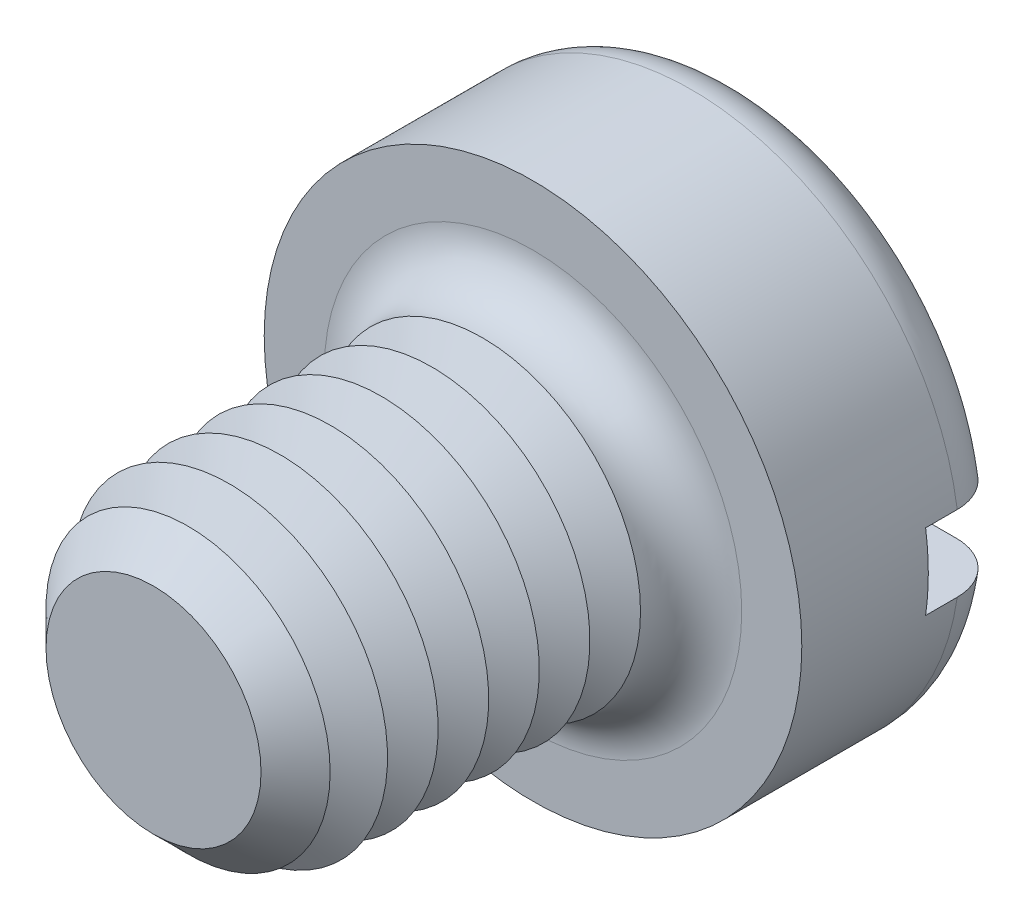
ISO-10303-21;
HEADER;
FILE_DESCRIPTION(('STEP AP214'),'2;1');
FILE_NAME('part.step','',(''),(''),'','','');
FILE_SCHEMA(('AUTOMOTIVE_DESIGN { 1 0 10303 214 1 1 1 1 }'));
ENDSEC;
DATA;
#1=APPLICATION_CONTEXT('core data for automotive mechanical design processes');
#2=APPLICATION_PROTOCOL_DEFINITION('international standard','automotive_design',2000,#1);
#3=PRODUCT_CONTEXT('',#1,'mechanical');
#4=PRODUCT('Part','Part','',(#3));
#5=PRODUCT_RELATED_PRODUCT_CATEGORY('part','',(#4));
#6=PRODUCT_DEFINITION_FORMATION('','',#4);
#7=PRODUCT_DEFINITION_CONTEXT('part definition',#1,'design');
#8=PRODUCT_DEFINITION('design','',#6,#7);
#9=PRODUCT_DEFINITION_SHAPE('','',#8);
#10=(LENGTH_UNIT() NAMED_UNIT(*) SI_UNIT(.MILLI.,.METRE.));
#11=(NAMED_UNIT(*) PLANE_ANGLE_UNIT() SI_UNIT($,.RADIAN.));
#12=(NAMED_UNIT(*) SI_UNIT($,.STERADIAN.) SOLID_ANGLE_UNIT());
#13=UNCERTAINTY_MEASURE_WITH_UNIT(LENGTH_MEASURE(1.E-05),#10,'distance_accuracy_value','');
#14=(GEOMETRIC_REPRESENTATION_CONTEXT(3) GLOBAL_UNCERTAINTY_ASSIGNED_CONTEXT((#13)) GLOBAL_UNIT_ASSIGNED_CONTEXT((#10,
#11,#12)) REPRESENTATION_CONTEXT('',''));
#15=CARTESIAN_POINT('',(0.,0.,0.));
#16=DIRECTION('',(0.,0.,1.));
#17=DIRECTION('',(1.,0.,0.));
#18=AXIS2_PLACEMENT_3D('',#15,#16,#17);
#19=CARTESIAN_POINT('',(0.,0.,-3.3));
#20=DIRECTION('',(0.,0.,1.));
#21=DIRECTION('',(1.,0.,0.));
#22=AXIS2_PLACEMENT_3D('',#19,#20,#21);
#23=PLANE('',#22);
#24=CARTESIAN_POINT('',(0.,0.,-3.3));
#25=DIRECTION('',(0.,0.,1.));
#26=DIRECTION('',(1.,0.,0.));
#27=AXIS2_PLACEMENT_3D('',#24,#25,#26);
#28=CIRCLE('',#27,3.45);
#29=CARTESIAN_POINT('',(-3.39742549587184,0.6,-3.3));
#30=VERTEX_POINT('',#29);
#31=CARTESIAN_POINT('',(3.39742549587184,0.599999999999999,-3.3));
#32=VERTEX_POINT('',#31);
#33=EDGE_CURVE('E116',#30,#32,#28,.F.);
#34=ORIENTED_EDGE('',*,*,#33,.T.);
#35=DIRECTION('',(1.,0.,0.));
#36=VECTOR('',#35,1.);
#37=CARTESIAN_POINT('',(-4.25,0.6,-3.3));
#38=LINE('',#37,#36);
#39=EDGE_CURVE('E111',#30,#32,#38,.T.);
#40=ORIENTED_EDGE('',*,*,#39,.F.);
#41=EDGE_LOOP('',(#34,#40));
#42=FACE_BOUND('',#41,.T.);
#43=ADVANCED_FACE('F39',(#42),#23,.F.);
#44=CARTESIAN_POINT('',(0.,0.,-2.5));
#45=DIRECTION('',(0.,0.,1.));
#46=DIRECTION('',(1.,0.,0.));
#47=AXIS2_PLACEMENT_3D('',#44,#45,#46);
#48=TOROIDAL_SURFACE('',#47,3.45,0.8);
#49=CARTESIAN_POINT('',(-4.06369072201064,0.6,-2.95537828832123));
#50=CARTESIAN_POINT('',(-4.03774340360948,0.6,-2.99245078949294));
#51=CARTESIAN_POINT('',(-4.00861849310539,0.6,-3.02734231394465));
#52=CARTESIAN_POINT('',(-3.94488199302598,0.6,-3.0917502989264));
#53=CARTESIAN_POINT('',(-3.91026320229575,0.6,-3.12125959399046));
#54=CARTESIAN_POINT('',(-3.83660561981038,0.6,-3.17403695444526));
#55=CARTESIAN_POINT('',(-3.79757117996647,0.6,-3.19731109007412));
#56=CARTESIAN_POINT('',(-3.71618817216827,0.6,-3.23703443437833));
#57=CARTESIAN_POINT('',(-3.67384041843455,0.6,-3.25348531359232));
#58=CARTESIAN_POINT('',(-3.58661930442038,0.6,-3.2792758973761));
#59=CARTESIAN_POINT('',(-3.54172669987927,0.6,-3.288550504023));
#60=CARTESIAN_POINT('',(-3.45102322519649,0.6,-3.29952632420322));
#61=CARTESIAN_POINT('',(-3.40521225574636,0.6,-3.30122671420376));
#62=CARTESIAN_POINT('',(-3.31340831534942,0.6,-3.29701196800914));
#63=CARTESIAN_POINT('',(-3.26741940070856,0.6,-3.29100823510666));
#64=CARTESIAN_POINT('',(-3.17708556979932,0.6,-3.27141469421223));
#65=CARTESIAN_POINT('',(-3.13274074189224,0.6,-3.25782447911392));
#66=CARTESIAN_POINT('',(-3.04668142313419,0.6,-3.22332549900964));
#67=CARTESIAN_POINT('',(-3.00498444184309,0.6,-3.20237301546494));
#68=CARTESIAN_POINT('',(-2.92572251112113,0.6,-3.15372961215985));
#69=CARTESIAN_POINT('',(-2.88815755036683,0.6,-3.12603871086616));
#70=CARTESIAN_POINT('',(-2.81847654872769,0.6,-3.06483322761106));
#71=CARTESIAN_POINT('',(-2.78633186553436,0.6,-3.03135128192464));
#72=CARTESIAN_POINT('',(-2.72824805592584,0.6,-2.95937651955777));
#73=CARTESIAN_POINT('',(-2.70230829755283,0.6,-2.92088421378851));
#74=CARTESIAN_POINT('',(-2.65791262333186,0.6,-2.84074227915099));
#75=CARTESIAN_POINT('',(-2.6393256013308,0.6,-2.79916531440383));
#76=CARTESIAN_POINT('',(-2.60958432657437,0.6,-2.7134333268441));
#77=CARTESIAN_POINT('',(-2.59842889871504,0.6,-2.66927871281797));
#78=CARTESIAN_POINT('',(-2.58411140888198,0.6,-2.58073966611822));
#79=CARTESIAN_POINT('',(-2.58077086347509,0.6,-2.5363840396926));
#80=CARTESIAN_POINT('',(-2.58167367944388,0.6,-2.44775208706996));
#81=CARTESIAN_POINT('',(-2.58591644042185,0.6,-2.40347575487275));
#82=CARTESIAN_POINT('',(-2.60175154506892,0.6,-2.31675105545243));
#83=CARTESIAN_POINT('',(-2.61326489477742,0.6,-2.27428821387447));
#84=CARTESIAN_POINT('',(-2.6431863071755,0.6,-2.19186794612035));
#85=CARTESIAN_POINT('',(-2.66159465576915,0.6,-2.15191062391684));
#86=CARTESIAN_POINT('',(-2.70494650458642,0.6,-2.07517696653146));
#87=CARTESIAN_POINT('',(-2.72995486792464,0.6,-2.03843731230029));
#88=CARTESIAN_POINT('',(-2.7856570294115,0.6,-1.96955746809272));
#89=CARTESIAN_POINT('',(-2.8163514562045,0.6,-1.93741778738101));
#90=CARTESIAN_POINT('',(-2.88329572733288,0.6,-1.87788048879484));
#91=CARTESIAN_POINT('',(-2.91965530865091,0.6,-1.85060625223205));
#92=CARTESIAN_POINT('',(-2.9963658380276,0.6,-1.80241044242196));
#93=CARTESIAN_POINT('',(-3.03671721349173,0.6,-1.78148955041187));
#94=CARTESIAN_POINT('',(-3.12111125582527,0.6,-1.74619829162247));
#95=CARTESIAN_POINT('',(-3.16521020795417,0.6,-1.73196239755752));
#96=CARTESIAN_POINT('',(-3.25516487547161,0.6,-1.71103773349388));
#97=CARTESIAN_POINT('',(-3.30102068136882,0.6,-1.70434935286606));
#98=CARTESIAN_POINT('',(-3.39352689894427,0.6,-1.69870104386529));
#99=CARTESIAN_POINT('',(-3.44018061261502,0.6,-1.69979487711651));
#100=CARTESIAN_POINT('',(-3.53263583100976,0.6,-1.70983959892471));
#101=CARTESIAN_POINT('',(-3.57843734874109,0.6,-1.71879036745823));
#102=CARTESIAN_POINT('',(-3.66763544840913,0.6,-1.74426972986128));
#103=CARTESIAN_POINT('',(-3.71104292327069,0.6,-1.76076015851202));
#104=CARTESIAN_POINT('',(-3.79442616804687,0.6,-1.80087686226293));
#105=CARTESIAN_POINT('',(-3.83440212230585,0.6,-1.82450275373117));
#106=CARTESIAN_POINT('',(-3.90929765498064,0.6,-1.87793548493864));
#107=CARTESIAN_POINT('',(-3.94426963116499,0.6,-1.90766887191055));
#108=CARTESIAN_POINT('',(-4.00864839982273,0.6,-1.9726503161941));
#109=CARTESIAN_POINT('',(-4.03805555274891,0.6,-2.00789801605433));
#110=CARTESIAN_POINT('',(-4.09009460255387,0.6,-2.08244463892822));
#111=CARTESIAN_POINT('',(-4.11280448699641,0.6,-2.12168912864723));
#112=CARTESIAN_POINT('',(-4.15124086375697,0.6,-2.2034588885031));
#113=CARTESIAN_POINT('',(-4.16696802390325,0.6,-2.24598384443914));
#114=CARTESIAN_POINT('',(-4.19085131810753,0.6,-2.33267862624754));
#115=CARTESIAN_POINT('',(-4.19907708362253,0.6,-2.37682928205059));
#116=CARTESIAN_POINT('',(-4.2079638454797,0.6,-2.46589754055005));
#117=CARTESIAN_POINT('',(-4.20862315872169,0.6,-2.51081531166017));
#118=CARTESIAN_POINT('',(-4.20236829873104,0.6,-2.59993343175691));
#119=CARTESIAN_POINT('',(-4.19548454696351,0.6,-2.64413593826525));
#120=CARTESIAN_POINT('',(-4.17439924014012,0.6,-2.73071930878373));
#121=CARTESIAN_POINT('',(-4.16020675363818,0.6,-2.77310235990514));
#122=CARTESIAN_POINT('',(-4.1318825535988,0.6,-2.83880495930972));
#123=CARTESIAN_POINT('',(-4.11991183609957,0.6,-2.86307959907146));
#124=CARTESIAN_POINT('',(-4.09356927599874,0.6,-2.91028856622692));
#125=CARTESIAN_POINT('',(-4.07919744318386,0.6,-2.9332228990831));
#126=CARTESIAN_POINT('',(-4.06369072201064,0.6,-2.95537828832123));
#127=B_SPLINE_CURVE_WITH_KNOTS('',3,(#49,#50,#51,#52,#53,#54,#55,#56,#57,#58,#59,#60,#61,#62,
#63,#64,#65,#66,#67,#68,#69,#70,#71,#72,#73,#74,#75,#76,#77,#78,#79,#80,#81,#82,#83,#84,#85,#86,
#87,#88,#89,#90,#91,#92,#93,#94,#95,#96,#97,#98,#99,#100,#101,#102,#103,#104,#105,#106,#107,
#108,#109,#110,#111,#112,#113,#114,#115,#116,#117,#118,#119,#120,#121,#122,#123,#124,#125,#126),
.UNSPECIFIED.,.T.,.F.,(4,2,2,2,2,2,2,2,2,2,2,2,2,2,2,2,2,2,2,2,2,2,2,2,2,2,2,2,2,2,2,2,2,2,2,2,
2,2,4),(0.,0.135652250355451,0.271483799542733,0.407182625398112,0.54284820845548,
0.679730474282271,0.81662762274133,0.95511327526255,1.09360635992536,1.23293614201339,
1.3722655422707,1.51083389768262,1.64938813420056,1.78534653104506,1.92128342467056,
2.0540840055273,2.18687407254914,2.31824564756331,2.44962267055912,2.58234229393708,
2.71507659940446,2.85080630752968,2.98655056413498,3.12491938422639,3.26329534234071,
3.40262816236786,3.54195885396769,3.68059194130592,3.81921757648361,3.95626453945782,
4.09330262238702,4.2286754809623,4.36403538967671,4.49812564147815,4.63224572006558,
4.76582687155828,4.89924267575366,4.98031194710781,5.06138088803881),.UNSPECIFIED.);
#128=CARTESIAN_POINT('',(-4.20743389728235,0.6,-2.50000000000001));
#129=VERTEX_POINT('',#128);
#130=EDGE_CURVE('E233',#129,#30,#127,.T.);
#131=ORIENTED_EDGE('',*,*,#130,.F.);
#132=CARTESIAN_POINT('',(0.,0.,-2.5));
#133=DIRECTION('',(0.,0.,1.));
#134=DIRECTION('',(1.,0.,0.));
#135=AXIS2_PLACEMENT_3D('',#132,#133,#134);
#136=CIRCLE('',#135,4.25);
#137=CARTESIAN_POINT('',(4.20743389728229,0.599999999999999,-2.5));
#138=VERTEX_POINT('',#137);
#139=EDGE_CURVE('E125',#138,#129,#136,.T.);
#140=ORIENTED_EDGE('',*,*,#139,.F.);
#141=CARTESIAN_POINT('',(2.63947327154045,0.6,-2.79608831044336));
#142=CARTESIAN_POINT('',(2.65655980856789,0.6,-2.83790320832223));
#143=CARTESIAN_POINT('',(2.67725642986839,0.6,-2.87828303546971));
#144=CARTESIAN_POINT('',(2.72519250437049,0.6,-2.95500233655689));
#145=CARTESIAN_POINT('',(2.75244152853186,0.6,-2.9913357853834));
#146=CARTESIAN_POINT('',(2.81257938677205,0.6,-3.05889430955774));
#147=CARTESIAN_POINT('',(2.84545995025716,0.6,-3.09012674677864));
#148=CARTESIAN_POINT('',(2.91591143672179,0.6,-3.14672620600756));
#149=CARTESIAN_POINT('',(2.95348119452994,0.599999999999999,-3.17209468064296));
#150=CARTESIAN_POINT('',(3.03291143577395,0.599999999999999,-3.21669611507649));
#151=CARTESIAN_POINT('',(3.07483186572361,0.599999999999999,-3.23582234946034));
#152=CARTESIAN_POINT('',(3.16126659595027,0.599999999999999,-3.26686062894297));
#153=CARTESIAN_POINT('',(3.2057811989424,0.599999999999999,-3.27877183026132));
#154=CARTESIAN_POINT('',(3.29669878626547,0.599999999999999,-3.29514603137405));
#155=CARTESIAN_POINT('',(3.34311773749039,0.599999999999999,-3.29952056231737));
#156=CARTESIAN_POINT('',(3.43603189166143,0.599999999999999,-3.30040472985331));
#157=CARTESIAN_POINT('',(3.48252709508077,0.599999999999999,-3.29691431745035));
#158=CARTESIAN_POINT('',(3.57420049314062,0.599999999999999,-3.28214240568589));
#159=CARTESIAN_POINT('',(3.61938038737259,0.599999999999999,-3.27087147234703));
#160=CARTESIAN_POINT('',(3.70717477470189,0.599999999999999,-3.24082890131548));
#161=CARTESIAN_POINT('',(3.74978938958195,0.599999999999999,-3.22205762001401));
#162=CARTESIAN_POINT('',(3.83078828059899,0.599999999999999,-3.17773607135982));
#163=CARTESIAN_POINT('',(3.86921015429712,0.599999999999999,-3.15225453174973));
#164=CARTESIAN_POINT('',(3.94116038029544,0.599999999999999,-3.09512672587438));
#165=CARTESIAN_POINT('',(3.9746890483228,0.599999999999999,-3.06348085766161));
#166=CARTESIAN_POINT('',(4.03545911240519,0.599999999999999,-2.99534640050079));
#167=CARTESIAN_POINT('',(4.06277344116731,0.599999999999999,-2.95892285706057));
#168=CARTESIAN_POINT('',(4.11082191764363,0.599999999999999,-2.88196698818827));
#169=CARTESIAN_POINT('',(4.13155647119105,0.599999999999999,-2.84143491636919));
#170=CARTESIAN_POINT('',(4.16563480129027,0.599999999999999,-2.75787550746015));
#171=CARTESIAN_POINT('',(4.1790544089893,0.599999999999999,-2.71487908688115));
#172=CARTESIAN_POINT('',(4.19843340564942,0.599999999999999,-2.62723691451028));
#173=CARTESIAN_POINT('',(4.20439310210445,0.599999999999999,-2.58259123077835));
#174=CARTESIAN_POINT('',(4.2086595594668,0.599999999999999,-2.49321831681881));
#175=CARTESIAN_POINT('',(4.20701422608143,0.599999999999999,-2.4484933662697));
#176=CARTESIAN_POINT('',(4.1962295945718,0.599999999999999,-2.35995704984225));
#177=CARTESIAN_POINT('',(4.18709040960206,0.599999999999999,-2.31614567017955));
#178=CARTESIAN_POINT('',(4.16160290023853,0.599999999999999,-2.23072100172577));
#179=CARTESIAN_POINT('',(4.14526169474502,0.599999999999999,-2.18910558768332));
#180=CARTESIAN_POINT('',(4.10585410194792,0.599999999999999,-2.10919238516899));
#181=CARTESIAN_POINT('',(4.08278762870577,0.599999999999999,-2.07089463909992));
#182=CARTESIAN_POINT('',(4.030487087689,0.599999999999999,-1.99851484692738));
#183=CARTESIAN_POINT('',(4.00122628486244,0.599999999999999,-1.9644521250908));
#184=CARTESIAN_POINT('',(3.93744772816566,0.599999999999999,-1.90166877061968));
#185=CARTESIAN_POINT('',(3.90292977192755,0.599999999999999,-1.87294834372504));
#186=CARTESIAN_POINT('',(3.82928727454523,0.599999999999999,-1.82137853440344));
#187=CARTESIAN_POINT('',(3.79012374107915,0.599999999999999,-1.79858484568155));
#188=CARTESIAN_POINT('',(3.70856025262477,0.599999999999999,-1.75980712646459));
#189=CARTESIAN_POINT('',(3.66616010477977,0.599999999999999,-1.74382350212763));
#190=CARTESIAN_POINT('',(3.57878495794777,0.599999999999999,-1.71891499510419));
#191=CARTESIAN_POINT('',(3.53378519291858,0.599999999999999,-1.71007699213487));
#192=CARTESIAN_POINT('',(3.44294322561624,0.599999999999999,-1.69998722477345));
#193=CARTESIAN_POINT('',(3.3971009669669,0.599999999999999,-1.69873596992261));
#194=CARTESIAN_POINT('',(3.30531297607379,0.599999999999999,-1.70385439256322));
#195=CARTESIAN_POINT('',(3.25937213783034,0.599999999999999,-1.71031204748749));
#196=CARTESIAN_POINT('',(3.1692099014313,0.599999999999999,-1.73080107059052));
#197=CARTESIAN_POINT('',(3.12498860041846,0.599999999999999,-1.74483286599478));
#198=CARTESIAN_POINT('',(3.03926209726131,0.599999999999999,-1.78018941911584));
#199=CARTESIAN_POINT('',(2.99777407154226,0.6,-1.80155586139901));
#200=CARTESIAN_POINT('',(2.91899881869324,0.6,-1.85098881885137));
#201=CARTESIAN_POINT('',(2.88171158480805,0.6,-1.8790553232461));
#202=CARTESIAN_POINT('',(2.81266124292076,0.6,-1.94094884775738));
#203=CARTESIAN_POINT('',(2.78086710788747,0.6,-1.97474122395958));
#204=CARTESIAN_POINT('',(2.72353615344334,0.6,-2.0472724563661));
#205=CARTESIAN_POINT('',(2.69799841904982,0.6,-2.08601058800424));
#206=CARTESIAN_POINT('',(2.65444718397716,0.6,-2.16655019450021));
#207=CARTESIAN_POINT('',(2.63629889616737,0.6,-2.20827875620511));
#208=CARTESIAN_POINT('',(2.60744942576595,0.6,-2.29424821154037));
#209=CARTESIAN_POINT('',(2.59674901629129,0.6,-2.33848936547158));
#210=CARTESIAN_POINT('',(2.5833312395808,0.6,-2.42714258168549));
#211=CARTESIAN_POINT('',(2.58043995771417,0.6,-2.47152848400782));
#212=CARTESIAN_POINT('',(2.58224493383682,0.6,-2.56010574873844));
#213=CARTESIAN_POINT('',(2.58693104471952,0.6,-2.60429729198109));
#214=CARTESIAN_POINT('',(2.60020046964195,0.6,-2.67311978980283));
#215=CARTESIAN_POINT('',(2.60635343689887,0.6,-2.69824441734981));
#216=CARTESIAN_POINT('',(2.62110140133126,0.6,-2.74776540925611));
#217=CARTESIAN_POINT('',(2.62969634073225,0.6,-2.77216179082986));
#218=CARTESIAN_POINT('',(2.63947327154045,0.6,-2.79608831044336));
#219=B_SPLINE_CURVE_WITH_KNOTS('',3,(#141,#142,#143,#144,#145,#146,#147,#148,#149,#150,#151,
#152,#153,#154,#155,#156,#157,#158,#159,#160,#161,#162,#163,#164,#165,#166,#167,#168,#169,#170,
#171,#172,#173,#174,#175,#176,#177,#178,#179,#180,#181,#182,#183,#184,#185,#186,#187,#188,#189,
#190,#191,#192,#193,#194,#195,#196,#197,#198,#199,#200,#201,#202,#203,#204,#205,#206,#207,#208,
#209,#210,#211,#212,#213,#214,#215,#216,#217,#218),.UNSPECIFIED.,.T.,.F.,(4,2,2,2,2,2,2,2,2,2,2,
2,2,2,2,2,2,2,2,2,2,2,2,2,2,2,2,2,2,2,2,2,2,2,2,2,2,2,4),(0.,0.135416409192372,
0.271031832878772,0.406449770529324,0.541834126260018,0.679424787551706,0.817031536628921,
0.956242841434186,1.09545501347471,1.23447850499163,1.37349539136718,1.51114036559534,
1.64877645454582,1.78470267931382,1.92062051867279,2.05510117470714,2.1895762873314,
2.32320547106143,2.45683263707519,2.59032801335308,2.72382509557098,2.85791055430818,
2.99200117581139,3.12730969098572,3.26262627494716,3.39956435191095,3.53651162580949,
3.67503685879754,3.81356990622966,3.95290367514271,4.09223721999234,4.23075602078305,
4.36925455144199,4.5050994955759,4.6409585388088,4.77376594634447,4.90639565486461,
4.98388287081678,5.06136825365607),.UNSPECIFIED.);
#220=EDGE_CURVE('E235',#32,#138,#219,.T.);
#221=ORIENTED_EDGE('',*,*,#220,.F.);
#222=ORIENTED_EDGE('',*,*,#33,.F.);
#223=EDGE_LOOP('',(#131,#140,#221,#222));
#224=FACE_BOUND('',#223,.T.);
#225=ADVANCED_FACE('F217',(#224),#48,.T.);
#226=CARTESIAN_POINT('',(0.,0.,-3.3));
#227=DIRECTION('',(0.,0.,1.));
#228=DIRECTION('',(1.,0.,0.));
#229=AXIS2_PLACEMENT_3D('',#226,#227,#228);
#230=CYLINDRICAL_SURFACE('',#229,4.25);
#231=DIRECTION('',(0.,0.,1.));
#232=VECTOR('',#231,1.);
#233=CARTESIAN_POINT('',(4.20743389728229,0.599999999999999,-3.3));
#234=LINE('',#233,#232);
#235=CARTESIAN_POINT('',(4.20743389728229,0.599999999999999,-2.));
#236=VERTEX_POINT('',#235);
#237=EDGE_CURVE('E250',#138,#236,#234,.T.);
#238=ORIENTED_EDGE('',*,*,#237,.F.);
#239=ORIENTED_EDGE('',*,*,#139,.T.);
#240=DIRECTION('',(0.,0.,1.));
#241=VECTOR('',#240,1.);
#242=CARTESIAN_POINT('',(-4.20743389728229,0.6,-3.3));
#243=LINE('',#242,#241);
#244=CARTESIAN_POINT('',(-4.20743389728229,0.6,-2.));
#245=VERTEX_POINT('',#244);
#246=EDGE_CURVE('E63',#245,#129,#243,.F.);
#247=ORIENTED_EDGE('',*,*,#246,.F.);
#248=CARTESIAN_POINT('',(0.,0.,-2.));
#249=DIRECTION('',(0.,0.,-1.));
#250=DIRECTION('',(-1.,0.,0.));
#251=AXIS2_PLACEMENT_3D('',#248,#249,#250);
#252=CIRCLE('',#251,4.25);
#253=CARTESIAN_POINT('',(-4.20743389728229,-0.6,-2.));
#254=VERTEX_POINT('',#253);
#255=EDGE_CURVE('E43',#245,#254,#252,.F.);
#256=ORIENTED_EDGE('',*,*,#255,.T.);
#257=DIRECTION('',(0.,0.,1.));
#258=VECTOR('',#257,1.);
#259=CARTESIAN_POINT('',(-4.20743389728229,-0.6,-3.3));
#260=LINE('',#259,#258);
#261=CARTESIAN_POINT('',(-4.20743389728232,-0.6,-2.5));
#262=VERTEX_POINT('',#261);
#263=EDGE_CURVE('E247',#262,#254,#260,.T.);
#264=ORIENTED_EDGE('',*,*,#263,.F.);
#265=CARTESIAN_POINT('',(4.20743389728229,-0.600000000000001,-2.5));
#266=VERTEX_POINT('',#265);
#267=EDGE_CURVE('E127',#262,#266,#136,.T.);
#268=ORIENTED_EDGE('',*,*,#267,.T.);
#269=DIRECTION('',(0.,0.,1.));
#270=VECTOR('',#269,1.);
#271=CARTESIAN_POINT('',(4.20743389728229,-0.600000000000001,-3.3));
#272=LINE('',#271,#270);
#273=CARTESIAN_POINT('',(4.20743389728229,-0.600000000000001,-2.));
#274=VERTEX_POINT('',#273);
#275=EDGE_CURVE('E55',#274,#266,#272,.F.);
#276=ORIENTED_EDGE('',*,*,#275,.F.);
#277=EDGE_CURVE('E11',#274,#236,#252,.F.);
#278=ORIENTED_EDGE('',*,*,#277,.T.);
#279=EDGE_LOOP('',(#238,#239,#247,#256,#264,#268,#276,#278));
#280=FACE_BOUND('',#279,.T.);
#281=CARTESIAN_POINT('',(0.,0.,0.));
#282=DIRECTION('',(0.,0.,1.));
#283=DIRECTION('',(1.,0.,0.));
#284=AXIS2_PLACEMENT_3D('',#281,#282,#283);
#285=CIRCLE('',#284,4.25);
#286=CARTESIAN_POINT('',(4.25,0.,0.));
#287=VERTEX_POINT('',#286);
#288=EDGE_CURVE('E253',#287,#287,#285,.T.);
#289=ORIENTED_EDGE('',*,*,#288,.F.);
#290=EDGE_LOOP('',(#289));
#291=FACE_BOUND('',#290,.T.);
#292=ADVANCED_FACE('F213',(#280,#291),#230,.T.);
#293=CARTESIAN_POINT('',(3.39742549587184,-0.600000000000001,-3.3));
#294=VERTEX_POINT('',#293);
#295=CARTESIAN_POINT('',(-3.39742549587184,-0.6,-3.3));
#296=VERTEX_POINT('',#295);
#297=EDGE_CURVE('E109',#294,#296,#28,.F.);
#298=ORIENTED_EDGE('',*,*,#297,.T.);
#299=DIRECTION('',(-1.,0.,0.));
#300=VECTOR('',#299,1.);
#301=CARTESIAN_POINT('',(-4.25,-0.6,-3.3));
#302=LINE('',#301,#300);
#303=EDGE_CURVE('E96',#294,#296,#302,.T.);
#304=ORIENTED_EDGE('',*,*,#303,.F.);
#305=EDGE_LOOP('',(#298,#304));
#306=FACE_BOUND('',#305,.T.);
#307=ADVANCED_FACE('F108',(#306),#23,.F.);
#308=CARTESIAN_POINT('',(0.,0.,0.));
#309=DIRECTION('',(0.,0.,1.));
#310=DIRECTION('',(1.,0.,0.));
#311=AXIS2_PLACEMENT_3D('',#308,#309,#310);
#312=PLANE('',#311);
#313=CARTESIAN_POINT('',(0.,0.,0.));
#314=DIRECTION('',(0.,0.,1.));
#315=DIRECTION('',(1.,0.,0.));
#316=AXIS2_PLACEMENT_3D('',#313,#314,#315);
#317=CIRCLE('',#316,3.3);
#318=CARTESIAN_POINT('',(3.3,0.,0.));
#319=VERTEX_POINT('',#318);
#320=EDGE_CURVE('E115',#319,#319,#317,.F.);
#321=ORIENTED_EDGE('',*,*,#320,.T.);
#322=EDGE_LOOP('',(#321));
#323=FACE_BOUND('',#322,.T.);
#324=ORIENTED_EDGE('',*,*,#288,.T.);
#325=EDGE_LOOP('',(#324));
#326=FACE_BOUND('',#325,.T.);
#327=ADVANCED_FACE('F212',(#323,#326),#312,.T.);
#328=CARTESIAN_POINT('',(-4.06369072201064,-0.6,-2.95537828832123));
#329=CARTESIAN_POINT('',(-4.08928577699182,-0.6,-2.91880204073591));
#330=CARTESIAN_POINT('',(-4.11182555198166,-0.6,-2.88005030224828));
#331=CARTESIAN_POINT('',(-4.15010404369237,-0.6,-2.79928452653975));
#332=CARTESIAN_POINT('',(-4.16583526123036,-0.6,-2.75726695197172));
#333=CARTESIAN_POINT('',(-4.19000286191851,-0.6,-2.67118996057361));
#334=CARTESIAN_POINT('',(-4.19844101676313,-0.6,-2.62713104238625));
#335=CARTESIAN_POINT('',(-4.20777174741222,-0.6,-2.53823222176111));
#336=CARTESIAN_POINT('',(-4.20866608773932,-0.6,-2.49339250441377));
#337=CARTESIAN_POINT('',(-4.20289683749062,-0.6,-2.40433856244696));
#338=CARTESIAN_POINT('',(-4.19625607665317,-0.6,-2.36012285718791));
#339=CARTESIAN_POINT('',(-4.17565084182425,-0.6,-2.27343166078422));
#340=CARTESIAN_POINT('',(-4.16168615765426,-0.6,-2.23095621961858));
#341=CARTESIAN_POINT('',(-4.12683188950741,-0.6,-2.14890863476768));
#342=CARTESIAN_POINT('',(-4.10593663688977,-0.6,-2.10933890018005));
#343=CARTESIAN_POINT('',(-4.05783763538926,-0.6,-2.03424145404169));
#344=CARTESIAN_POINT('',(-4.03063375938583,-0.6,-1.99871382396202));
#345=CARTESIAN_POINT('',(-3.97052236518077,-0.6,-1.93246905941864));
#346=CARTESIAN_POINT('',(-3.93758114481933,-0.6,-1.90178251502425));
#347=CARTESIAN_POINT('',(-3.86706007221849,-0.6,-1.84630837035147));
#348=CARTESIAN_POINT('',(-3.82948001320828,-0.6,-1.82152103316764));
#349=CARTESIAN_POINT('',(-3.75033766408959,-0.6,-1.77826995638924));
#350=CARTESIAN_POINT('',(-3.70873831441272,-0.6,-1.7598740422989));
#351=CARTESIAN_POINT('',(-3.62306661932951,-0.6,-1.73023196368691));
#352=CARTESIAN_POINT('',(-3.57899411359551,-0.6,-1.71898626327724));
#353=CARTESIAN_POINT('',(-3.48904845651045,-0.6,-1.70382025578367));
#354=CARTESIAN_POINT('',(-3.44315982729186,-0.6,-1.69999172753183));
#355=CARTESIAN_POINT('',(-3.35138360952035,-0.6,-1.7000083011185));
#356=CARTESIAN_POINT('',(-3.30549602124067,-0.6,-1.70385391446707));
#357=CARTESIAN_POINT('',(-3.21452492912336,-0.6,-1.71917227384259));
#358=CARTESIAN_POINT('',(-3.16945455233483,-0.6,-1.73072307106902));
#359=CARTESIAN_POINT('',(-3.08188104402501,-0.6,-1.76120640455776));
#360=CARTESIAN_POINT('',(-3.0393780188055,-0.6,-1.78013924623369));
#361=CARTESIAN_POINT('',(-2.95805296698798,-0.6,-1.82493384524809));
#362=CARTESIAN_POINT('',(-2.91924039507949,-0.6,-1.85081278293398));
#363=CARTESIAN_POINT('',(-2.84656695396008,-0.6,-1.90878317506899));
#364=CARTESIAN_POINT('',(-2.81270591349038,-0.6,-1.94087441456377));
#365=CARTESIAN_POINT('',(-2.75131050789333,-0.6,-2.01002500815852));
#366=CARTESIAN_POINT('',(-2.72371339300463,-0.6,-2.04702860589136));
#367=CARTESIAN_POINT('',(-2.67528742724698,-0.6,-2.12522869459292));
#368=CARTESIAN_POINT('',(-2.65445765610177,-0.6,-2.1664246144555));
#369=CARTESIAN_POINT('',(-2.62065354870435,-0.6,-2.25087266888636));
#370=CARTESIAN_POINT('',(-2.60751663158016,-0.6,-2.29405971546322));
#371=CARTESIAN_POINT('',(-2.58885106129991,-0.6,-2.38204659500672));
#372=CARTESIAN_POINT('',(-2.58332131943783,-0.6,-2.42684619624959));
#373=CARTESIAN_POINT('',(-2.58009777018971,-0.6,-2.51580379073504));
#374=CARTESIAN_POINT('',(-2.58224575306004,-0.6,-2.55995612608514));
#375=CARTESIAN_POINT('',(-2.59395205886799,-0.6,-2.64726495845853));
#376=CARTESIAN_POINT('',(-2.60351013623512,-0.6,-2.69042148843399));
#377=CARTESIAN_POINT('',(-2.62967159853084,-0.6,-2.77438771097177));
#378=CARTESIAN_POINT('',(-2.64625243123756,-0.6,-2.81520444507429));
#379=CARTESIAN_POINT('',(-2.68592348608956,-0.6,-2.89353901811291));
#380=CARTESIAN_POINT('',(-2.70901418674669,-0.6,-2.9310566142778));
#381=CARTESIAN_POINT('',(-2.7614318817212,-0.6,-3.00240040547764));
#382=CARTESIAN_POINT('',(-2.79085487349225,-0.6,-3.03615603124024));
#383=CARTESIAN_POINT('',(-2.85483456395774,-0.6,-3.09838834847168));
#384=CARTESIAN_POINT('',(-2.88939187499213,-0.6,-3.12686440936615));
#385=CARTESIAN_POINT('',(-2.96351967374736,-0.6,-3.17841283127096));
#386=CARTESIAN_POINT('',(-3.00318741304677,-0.6,-3.20134539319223));
#387=CARTESIAN_POINT('',(-3.08576649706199,-0.6,-3.24034364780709));
#388=CARTESIAN_POINT('',(-3.12867814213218,-0.6,-3.25640870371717));
#389=CARTESIAN_POINT('',(-3.21724048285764,-0.6,-3.28143816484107));
#390=CARTESIAN_POINT('',(-3.26292314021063,-0.6,-3.29028963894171));
#391=CARTESIAN_POINT('',(-3.35512527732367,-0.6,-3.30021681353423));
#392=CARTESIAN_POINT('',(-3.40164474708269,-0.6,-3.30129260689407));
#393=CARTESIAN_POINT('',(-3.49429978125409,-0.6,-3.29560589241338));
#394=CARTESIAN_POINT('',(-3.54043436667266,-0.6,-3.28882735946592));
#395=CARTESIAN_POINT('',(-3.63090382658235,-0.6,-3.26755492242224));
#396=CARTESIAN_POINT('',(-3.67523831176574,-0.6,-3.25305935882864));
#397=CARTESIAN_POINT('',(-3.76046509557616,-0.6,-3.21686867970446));
#398=CARTESIAN_POINT('',(-3.80138087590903,-0.6,-3.1952288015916));
#399=CARTESIAN_POINT('',(-3.8788986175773,-0.6,-3.14531817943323));
#400=CARTESIAN_POINT('',(-3.91550599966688,-0.6,-3.11705590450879));
#401=CARTESIAN_POINT('',(-3.97074313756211,-0.6,-3.06628809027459));
#402=CARTESIAN_POINT('',(-3.99100743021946,-0.6,-3.04553102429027));
#403=CARTESIAN_POINT('',(-4.02917385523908,-0.6,-3.00194762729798));
#404=CARTESIAN_POINT('',(-4.04707600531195,-0.6,-2.97912131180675));
#405=CARTESIAN_POINT('',(-4.06369072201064,-0.6,-2.95537828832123));
#406=B_SPLINE_CURVE_WITH_KNOTS('',3,(#328,#329,#330,#331,#332,#333,#334,#335,#336,#337,#338,
#339,#340,#341,#342,#343,#344,#345,#346,#347,#348,#349,#350,#351,#352,#353,#354,#355,#356,#357,
#358,#359,#360,#361,#362,#363,#364,#365,#366,#367,#368,#369,#370,#371,#372,#373,#374,#375,#376,
#377,#378,#379,#380,#381,#382,#383,#384,#385,#386,#387,#388,#389,#390,#391,#392,#393,#394,#395,
#396,#397,#398,#399,#400,#401,#402,#403,#404,#405),.UNSPECIFIED.,.T.,.F.,(4,2,2,2,2,2,2,2,2,2,2,
2,2,2,2,2,2,2,2,2,2,2,2,2,2,2,2,2,2,2,2,2,2,2,2,2,2,2,4),(0.,0.133821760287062,
0.267790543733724,0.401726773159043,0.535631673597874,0.669131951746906,0.802636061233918,
0.936249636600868,1.06986590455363,1.2042952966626,1.3387306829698,1.47455198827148,
1.61038210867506,1.74788249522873,1.88539204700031,2.02431612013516,2.16324594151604,
2.30252260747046,2.4417944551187,2.57960263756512,2.71739207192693,2.85215325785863,
2.98689515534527,3.11887666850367,3.25085380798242,3.38241030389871,3.51397647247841,
3.64769871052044,3.78143690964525,3.91826005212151,4.05509587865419,4.19403485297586,
4.33297216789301,4.47219345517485,4.61144469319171,4.74964356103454,4.887666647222,
4.97453605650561,5.06140481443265),.UNSPECIFIED.);
#407=EDGE_CURVE('E103',#296,#262,#406,.T.);
#408=ORIENTED_EDGE('',*,*,#407,.F.);
#409=ORIENTED_EDGE('',*,*,#297,.F.);
#410=CARTESIAN_POINT('',(2.63947327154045,-0.6,-2.79608831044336));
#411=CARTESIAN_POINT('',(2.62285766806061,-0.6,-2.75541510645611));
#412=CARTESIAN_POINT('',(2.60963282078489,-0.6,-2.71332585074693));
#413=CARTESIAN_POINT('',(2.59042394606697,-0.6,-2.62749460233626));
#414=CARTESIAN_POINT('',(2.58444686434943,-0.6,-2.58375106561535));
#415=CARTESIAN_POINT('',(2.57995287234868,-0.6,-2.49588524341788));
#416=CARTESIAN_POINT('',(2.58143477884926,-0.6,-2.45176301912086));
#417=CARTESIAN_POINT('',(2.59180622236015,-0.6,-2.36440906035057));
#418=CARTESIAN_POINT('',(2.60069434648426,-0.6,-2.32117715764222));
#419=CARTESIAN_POINT('',(2.62554964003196,-0.6,-2.23689909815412));
#420=CARTESIAN_POINT('',(2.6415022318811,-0.6,-2.19584863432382));
#421=CARTESIAN_POINT('',(2.67996913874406,-0.6,-2.11694797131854));
#422=CARTESIAN_POINT('',(2.70248409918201,-0.6,-2.07909808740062));
#423=CARTESIAN_POINT('',(2.75378972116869,-0.6,-2.00702296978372));
#424=CARTESIAN_POINT('',(2.7826732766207,-0.6,-1.97286389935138));
#425=CARTESIAN_POINT('',(2.84564717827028,-0.6,-1.90974167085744));
#426=CARTESIAN_POINT('',(2.87973812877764,-0.6,-1.88077911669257));
#427=CARTESIAN_POINT('',(2.95300941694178,-0.6,-1.82817307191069));
#428=CARTESIAN_POINT('',(2.99228920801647,-0.600000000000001,-1.8046680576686));
#429=CARTESIAN_POINT('',(3.07419050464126,-0.600000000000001,-1.76446470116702));
#430=CARTESIAN_POINT('',(3.11681231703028,-0.600000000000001,-1.74776698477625));
#431=CARTESIAN_POINT('',(3.20492149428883,-0.600000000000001,-1.72140945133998));
#432=CARTESIAN_POINT('',(3.25044365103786,-0.600000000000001,-1.71186578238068));
#433=CARTESIAN_POINT('',(3.34244451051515,-0.600000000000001,-1.70053183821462));
#434=CARTESIAN_POINT('',(3.38892324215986,-0.600000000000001,-1.69874179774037));
#435=CARTESIAN_POINT('',(3.48165030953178,-0.600000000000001,-1.70299737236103));
#436=CARTESIAN_POINT('',(3.52789766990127,-0.600000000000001,-1.70906439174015));
#437=CARTESIAN_POINT('',(3.61869999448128,-0.600000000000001,-1.72893768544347));
#438=CARTESIAN_POINT('',(3.66325501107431,-0.600000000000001,-1.74274372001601));
#439=CARTESIAN_POINT('',(3.7490339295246,-0.600000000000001,-1.77760539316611));
#440=CARTESIAN_POINT('',(3.79028083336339,-0.600000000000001,-1.79860440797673));
#441=CARTESIAN_POINT('',(3.86860401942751,-0.600000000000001,-1.84731105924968));
#442=CARTESIAN_POINT('',(3.90568056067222,-0.600000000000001,-1.87501827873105));
#443=CARTESIAN_POINT('',(3.97412845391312,-0.600000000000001,-1.93599408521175));
#444=CARTESIAN_POINT('',(4.00556369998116,-0.600000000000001,-1.96919094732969));
#445=CARTESIAN_POINT('',(4.06233546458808,-0.600000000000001,-2.0404445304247));
#446=CARTESIAN_POINT('',(4.08767237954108,-0.600000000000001,-2.07850093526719));
#447=CARTESIAN_POINT('',(4.13122502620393,-0.600000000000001,-2.15791791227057));
#448=CARTESIAN_POINT('',(4.14951966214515,-0.600000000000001,-2.19923522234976));
#449=CARTESIAN_POINT('',(4.17884974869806,-0.600000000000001,-2.28437065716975));
#450=CARTESIAN_POINT('',(4.18988555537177,-0.600000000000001,-2.32818865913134));
#451=CARTESIAN_POINT('',(4.20430724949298,-0.600000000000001,-2.41670951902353));
#452=CARTESIAN_POINT('',(4.2077528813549,-0.600000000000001,-2.46140265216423));
#453=CARTESIAN_POINT('',(4.20706844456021,-0.600000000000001,-2.55073028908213));
#454=CARTESIAN_POINT('',(4.20293856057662,-0.600000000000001,-2.595364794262));
#455=CARTESIAN_POINT('',(4.18724926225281,-0.600000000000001,-2.68317733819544));
#456=CARTESIAN_POINT('',(4.17571081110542,-0.600000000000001,-2.72635912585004));
#457=CARTESIAN_POINT('',(4.14556645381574,-0.600000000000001,-2.81017999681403));
#458=CARTESIAN_POINT('',(4.12696052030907,-0.600000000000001,-2.85081907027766));
#459=CARTESIAN_POINT('',(4.08317014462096,-0.600000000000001,-2.92852328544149));
#460=CARTESIAN_POINT('',(4.0579684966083,-0.600000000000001,-2.96557872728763));
#461=CARTESIAN_POINT('',(4.00174565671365,-0.600000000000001,-3.034972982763));
#462=CARTESIAN_POINT('',(3.97072429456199,-0.600000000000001,-3.06731165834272));
#463=CARTESIAN_POINT('',(3.90349659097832,-0.600000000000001,-3.12662735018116));
#464=CARTESIAN_POINT('',(3.86725240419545,-0.600000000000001,-3.15356146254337));
#465=CARTESIAN_POINT('',(3.79079809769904,-0.600000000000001,-3.20104156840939));
#466=CARTESIAN_POINT('',(3.75058775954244,-0.600000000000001,-3.22158720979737));
#467=CARTESIAN_POINT('',(3.6668595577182,-0.600000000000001,-3.25595832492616));
#468=CARTESIAN_POINT('',(3.62330947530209,-0.600000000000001,-3.26970530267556));
#469=CARTESIAN_POINT('',(3.53453348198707,-0.600000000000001,-3.28979004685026));
#470=CARTESIAN_POINT('',(3.48930745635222,-0.600000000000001,-3.29612730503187));
#471=CARTESIAN_POINT('',(3.39787506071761,-0.600000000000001,-3.30128612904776));
#472=CARTESIAN_POINT('',(3.35166346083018,-0.600000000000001,-3.30001513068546));
#473=CARTESIAN_POINT('',(3.26009663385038,-0.600000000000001,-3.28980210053));
#474=CARTESIAN_POINT('',(3.21474142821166,-0.600000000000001,-3.28085987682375));
#475=CARTESIAN_POINT('',(3.12577990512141,-0.600000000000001,-3.2554540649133));
#476=CARTESIAN_POINT('',(3.08219120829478,-0.600000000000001,-3.23892872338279));
#477=CARTESIAN_POINT('',(2.99839730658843,-0.600000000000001,-3.1987810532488));
#478=CARTESIAN_POINT('',(2.95819301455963,-0.6,-3.17515681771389));
#479=CARTESIAN_POINT('',(2.88239372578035,-0.6,-3.12147666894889));
#480=CARTESIAN_POINT('',(2.84679445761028,-0.6,-3.09142678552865));
#481=CARTESIAN_POINT('',(2.78127483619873,-0.6,-3.02571584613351));
#482=CARTESIAN_POINT('',(2.75134725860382,-0.6,-2.99006203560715));
#483=CARTESIAN_POINT('',(2.70767232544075,-0.6,-2.92780516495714));
#484=CARTESIAN_POINT('',(2.69197340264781,-0.6,-2.90254809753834));
#485=CARTESIAN_POINT('',(2.66349078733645,-0.6,-2.8504392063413));
#486=CARTESIAN_POINT('',(2.65070705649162,-0.6,-2.82358740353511));
#487=CARTESIAN_POINT('',(2.63947327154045,-0.6,-2.79608831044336));
#488=B_SPLINE_CURVE_WITH_KNOTS('',3,(#410,#411,#412,#413,#414,#415,#416,#417,#418,#419,#420,
#421,#422,#423,#424,#425,#426,#427,#428,#429,#430,#431,#432,#433,#434,#435,#436,#437,#438,#439,
#440,#441,#442,#443,#444,#445,#446,#447,#448,#449,#450,#451,#452,#453,#454,#455,#456,#457,#458,
#459,#460,#461,#462,#463,#464,#465,#466,#467,#468,#469,#470,#471,#472,#473,#474,#475,#476,#477,
#478,#479,#480,#481,#482,#483,#484,#485,#486,#487),.UNSPECIFIED.,.T.,.F.,(4,2,2,2,2,2,2,2,2,2,2,
2,2,2,2,2,2,2,2,2,2,2,2,2,2,2,2,2,2,2,2,2,2,2,2,2,2,2,4),(0.,0.131701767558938,
0.263529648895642,0.395336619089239,0.527118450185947,0.658629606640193,0.790153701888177,
0.923740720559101,1.05734325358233,1.19403504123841,1.33073939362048,1.46961778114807,
1.60850037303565,1.74776210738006,1.88701952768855,2.02520497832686,2.16338184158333,
2.29987843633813,2.43636615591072,2.57127672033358,2.7061806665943,2.84001889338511,
2.97385385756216,3.1073117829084,3.24077022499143,3.37458034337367,3.50839437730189,
3.64323196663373,3.77807698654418,3.91444452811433,4.05082142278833,4.18886086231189,
4.32690375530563,4.46609131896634,4.60531630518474,4.74441121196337,4.88332773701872,
4.97237227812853,5.06141564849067),.UNSPECIFIED.);
#489=EDGE_CURVE('E92',#266,#294,#488,.T.);
#490=ORIENTED_EDGE('',*,*,#489,.F.);
#491=ORIENTED_EDGE('',*,*,#267,.F.);
#492=EDGE_LOOP('',(#408,#409,#490,#491));
#493=FACE_BOUND('',#492,.T.);
#494=ADVANCED_FACE('F113',(#493),#48,.T.);
#495=CARTESIAN_POINT('',(0.,0.,0.8));
#496=DIRECTION('',(0.,0.,1.));
#497=DIRECTION('',(1.,0.,0.));
#498=AXIS2_PLACEMENT_3D('',#495,#496,#497);
#499=TOROIDAL_SURFACE('',#498,3.3,0.8);
#500=ORIENTED_EDGE('',*,*,#320,.F.);
#501=EDGE_LOOP('',(#500));
#502=FACE_BOUND('',#501,.T.);
#503=CARTESIAN_POINT('',(0.,0.,0.8));
#504=DIRECTION('',(0.,0.,-1.));
#505=DIRECTION('',(-1.,0.,0.));
#506=AXIS2_PLACEMENT_3D('',#503,#504,#505);
#507=CIRCLE('',#506,2.5);
#508=CARTESIAN_POINT('',(-2.5,0.,0.8));
#509=VERTEX_POINT('',#508);
#510=EDGE_CURVE('E256',#509,#509,#507,.T.);
#511=ORIENTED_EDGE('',*,*,#510,.T.);
#512=EDGE_LOOP('',(#511));
#513=FACE_BOUND('',#512,.T.);
#514=ADVANCED_FACE('F205',(#502,#513),#499,.F.);
#515=CARTESIAN_POINT('',(0.,0.,1.2));
#516=DIRECTION('',(0.,0.,-1.));
#517=DIRECTION('',(-1.,0.,0.));
#518=AXIS2_PLACEMENT_3D('',#515,#516,#517);
#519=CONICAL_SURFACE('',#518,1.80717967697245,1.0471975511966);
#520=ORIENTED_EDGE('',*,*,#510,.F.);
#521=EDGE_LOOP('',(#520));
#522=FACE_BOUND('',#521,.T.);
#523=CARTESIAN_POINT('',(0.,0.,1.2));
#524=DIRECTION('',(0.,0.,-1.));
#525=DIRECTION('',(-1.,0.,0.));
#526=AXIS2_PLACEMENT_3D('',#523,#524,#525);
#527=CIRCLE('',#526,1.80717967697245);
#528=CARTESIAN_POINT('',(-1.80717967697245,0.,1.2));
#529=VERTEX_POINT('',#528);
#530=EDGE_CURVE('E262',#529,#529,#527,.T.);
#531=ORIENTED_EDGE('',*,*,#530,.T.);
#532=EDGE_LOOP('',(#531));
#533=FACE_BOUND('',#532,.T.);
#534=ADVANCED_FACE('F201',(#522,#533),#519,.T.);
#535=CARTESIAN_POINT('',(0.,0.,1.6));
#536=DIRECTION('',(0.,0.,1.));
#537=DIRECTION('',(1.,0.,0.));
#538=AXIS2_PLACEMENT_3D('',#535,#536,#537);
#539=CONICAL_SURFACE('',#538,2.5,1.0471975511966);
#540=ORIENTED_EDGE('',*,*,#530,.F.);
#541=EDGE_LOOP('',(#540));
#542=FACE_BOUND('',#541,.T.);
#543=CARTESIAN_POINT('',(0.,0.,1.6));
#544=DIRECTION('',(0.,0.,-1.));
#545=DIRECTION('',(-1.,0.,0.));
#546=AXIS2_PLACEMENT_3D('',#543,#544,#545);
#547=CIRCLE('',#546,2.5);
#548=CARTESIAN_POINT('',(-2.5,0.,1.6));
#549=VERTEX_POINT('',#548);
#550=EDGE_CURVE('E267',#549,#549,#547,.T.);
#551=ORIENTED_EDGE('',*,*,#550,.T.);
#552=EDGE_LOOP('',(#551));
#553=FACE_BOUND('',#552,.T.);
#554=ADVANCED_FACE('F197',(#542,#553),#539,.T.);
#555=CARTESIAN_POINT('',(0.,0.,2.));
#556=DIRECTION('',(0.,0.,-1.));
#557=DIRECTION('',(-1.,0.,0.));
#558=AXIS2_PLACEMENT_3D('',#555,#556,#557);
#559=CONICAL_SURFACE('',#558,1.80717967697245,1.0471975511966);
#560=ORIENTED_EDGE('',*,*,#550,.F.);
#561=EDGE_LOOP('',(#560));
#562=FACE_BOUND('',#561,.T.);
#563=CARTESIAN_POINT('',(0.,0.,2.));
#564=DIRECTION('',(0.,0.,-1.));
#565=DIRECTION('',(-1.,0.,0.));
#566=AXIS2_PLACEMENT_3D('',#563,#564,#565);
#567=CIRCLE('',#566,1.80717967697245);
#568=CARTESIAN_POINT('',(-1.80717967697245,0.,2.));
#569=VERTEX_POINT('',#568);
#570=EDGE_CURVE('E270',#569,#569,#567,.T.);
#571=ORIENTED_EDGE('',*,*,#570,.T.);
#572=EDGE_LOOP('',(#571));
#573=FACE_BOUND('',#572,.T.);
#574=ADVANCED_FACE('F193',(#562,#573),#559,.T.);
#575=CARTESIAN_POINT('',(0.,0.,2.4));
#576=DIRECTION('',(0.,0.,1.));
#577=DIRECTION('',(1.,0.,0.));
#578=AXIS2_PLACEMENT_3D('',#575,#576,#577);
#579=CONICAL_SURFACE('',#578,2.5,1.0471975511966);
#580=ORIENTED_EDGE('',*,*,#570,.F.);
#581=EDGE_LOOP('',(#580));
#582=FACE_BOUND('',#581,.T.);
#583=CARTESIAN_POINT('',(0.,0.,2.4));
#584=DIRECTION('',(0.,0.,-1.));
#585=DIRECTION('',(-1.,0.,0.));
#586=AXIS2_PLACEMENT_3D('',#583,#584,#585);
#587=CIRCLE('',#586,2.5);
#588=CARTESIAN_POINT('',(-2.5,0.,2.4));
#589=VERTEX_POINT('',#588);
#590=EDGE_CURVE('E274',#589,#589,#587,.T.);
#591=ORIENTED_EDGE('',*,*,#590,.T.);
#592=EDGE_LOOP('',(#591));
#593=FACE_BOUND('',#592,.T.);
#594=ADVANCED_FACE('F189',(#582,#593),#579,.T.);
#595=CARTESIAN_POINT('',(0.,0.,2.8));
#596=DIRECTION('',(0.,0.,-1.));
#597=DIRECTION('',(-1.,0.,0.));
#598=AXIS2_PLACEMENT_3D('',#595,#596,#597);
#599=CONICAL_SURFACE('',#598,1.80717967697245,1.0471975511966);
#600=ORIENTED_EDGE('',*,*,#590,.F.);
#601=EDGE_LOOP('',(#600));
#602=FACE_BOUND('',#601,.T.);
#603=CARTESIAN_POINT('',(0.,0.,2.8));
#604=DIRECTION('',(0.,0.,-1.));
#605=DIRECTION('',(-1.,0.,0.));
#606=AXIS2_PLACEMENT_3D('',#603,#604,#605);
#607=CIRCLE('',#606,1.80717967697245);
#608=CARTESIAN_POINT('',(-1.80717967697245,0.,2.8));
#609=VERTEX_POINT('',#608);
#610=EDGE_CURVE('E278',#609,#609,#607,.T.);
#611=ORIENTED_EDGE('',*,*,#610,.T.);
#612=EDGE_LOOP('',(#611));
#613=FACE_BOUND('',#612,.T.);
#614=ADVANCED_FACE('F185',(#602,#613),#599,.T.);
#615=CARTESIAN_POINT('',(0.,0.,3.2));
#616=DIRECTION('',(0.,0.,1.));
#617=DIRECTION('',(1.,0.,0.));
#618=AXIS2_PLACEMENT_3D('',#615,#616,#617);
#619=CONICAL_SURFACE('',#618,2.5,1.0471975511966);
#620=ORIENTED_EDGE('',*,*,#610,.F.);
#621=EDGE_LOOP('',(#620));
#622=FACE_BOUND('',#621,.T.);
#623=CARTESIAN_POINT('',(0.,0.,3.2));
#624=DIRECTION('',(0.,0.,-1.));
#625=DIRECTION('',(-1.,0.,0.));
#626=AXIS2_PLACEMENT_3D('',#623,#624,#625);
#627=CIRCLE('',#626,2.5);
#628=CARTESIAN_POINT('',(-2.5,0.,3.2));
#629=VERTEX_POINT('',#628);
#630=EDGE_CURVE('E282',#629,#629,#627,.T.);
#631=ORIENTED_EDGE('',*,*,#630,.T.);
#632=EDGE_LOOP('',(#631));
#633=FACE_BOUND('',#632,.T.);
#634=ADVANCED_FACE('F181',(#622,#633),#619,.T.);
#635=CARTESIAN_POINT('',(0.,0.,3.6));
#636=DIRECTION('',(0.,0.,-1.));
#637=DIRECTION('',(-1.,0.,0.));
#638=AXIS2_PLACEMENT_3D('',#635,#636,#637);
#639=CONICAL_SURFACE('',#638,1.80717967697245,1.0471975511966);
#640=ORIENTED_EDGE('',*,*,#630,.F.);
#641=EDGE_LOOP('',(#640));
#642=FACE_BOUND('',#641,.T.);
#643=CARTESIAN_POINT('',(0.,0.,3.6));
#644=DIRECTION('',(0.,0.,-1.));
#645=DIRECTION('',(-1.,0.,0.));
#646=AXIS2_PLACEMENT_3D('',#643,#644,#645);
#647=CIRCLE('',#646,1.80717967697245);
#648=CARTESIAN_POINT('',(-1.80717967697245,0.,3.6));
#649=VERTEX_POINT('',#648);
#650=EDGE_CURVE('E286',#649,#649,#647,.T.);
#651=ORIENTED_EDGE('',*,*,#650,.T.);
#652=EDGE_LOOP('',(#651));
#653=FACE_BOUND('',#652,.T.);
#654=ADVANCED_FACE('F177',(#642,#653),#639,.T.);
#655=CARTESIAN_POINT('',(0.,0.,4.));
#656=DIRECTION('',(0.,0.,1.));
#657=DIRECTION('',(1.,0.,0.));
#658=AXIS2_PLACEMENT_3D('',#655,#656,#657);
#659=CONICAL_SURFACE('',#658,2.5,1.0471975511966);
#660=ORIENTED_EDGE('',*,*,#650,.F.);
#661=EDGE_LOOP('',(#660));
#662=FACE_BOUND('',#661,.T.);
#663=CARTESIAN_POINT('',(0.,0.,4.));
#664=DIRECTION('',(0.,0.,-1.));
#665=DIRECTION('',(-1.,0.,0.));
#666=AXIS2_PLACEMENT_3D('',#663,#664,#665);
#667=CIRCLE('',#666,2.5);
#668=CARTESIAN_POINT('',(-2.5,0.,4.));
#669=VERTEX_POINT('',#668);
#670=EDGE_CURVE('E290',#669,#669,#667,.T.);
#671=ORIENTED_EDGE('',*,*,#670,.T.);
#672=EDGE_LOOP('',(#671));
#673=FACE_BOUND('',#672,.T.);
#674=ADVANCED_FACE('F173',(#662,#673),#659,.T.);
#675=CARTESIAN_POINT('',(0.,0.,4.4));
#676=DIRECTION('',(0.,0.,-1.));
#677=DIRECTION('',(-1.,0.,0.));
#678=AXIS2_PLACEMENT_3D('',#675,#676,#677);
#679=CONICAL_SURFACE('',#678,1.80717967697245,1.0471975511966);
#680=ORIENTED_EDGE('',*,*,#670,.F.);
#681=EDGE_LOOP('',(#680));
#682=FACE_BOUND('',#681,.T.);
#683=CARTESIAN_POINT('',(0.,0.,4.4));
#684=DIRECTION('',(0.,0.,-1.));
#685=DIRECTION('',(-1.,0.,0.));
#686=AXIS2_PLACEMENT_3D('',#683,#684,#685);
#687=CIRCLE('',#686,1.80717967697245);
#688=CARTESIAN_POINT('',(-1.80717967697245,0.,4.4));
#689=VERTEX_POINT('',#688);
#690=EDGE_CURVE('E136',#689,#689,#687,.T.);
#691=ORIENTED_EDGE('',*,*,#690,.T.);
#692=EDGE_LOOP('',(#691));
#693=FACE_BOUND('',#692,.T.);
#694=ADVANCED_FACE('F169',(#682,#693),#679,.T.);
#695=CARTESIAN_POINT('',(0.,0.,4.8));
#696=DIRECTION('',(0.,0.,1.));
#697=DIRECTION('',(1.,0.,0.));
#698=AXIS2_PLACEMENT_3D('',#695,#696,#697);
#699=CONICAL_SURFACE('',#698,2.5,1.0471975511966);
#700=ORIENTED_EDGE('',*,*,#690,.F.);
#701=EDGE_LOOP('',(#700));
#702=FACE_BOUND('',#701,.T.);
#703=CARTESIAN_POINT('',(0.,0.,4.8));
#704=DIRECTION('',(0.,0.,-1.));
#705=DIRECTION('',(-1.,0.,0.));
#706=AXIS2_PLACEMENT_3D('',#703,#704,#705);
#707=CIRCLE('',#706,2.5);
#708=CARTESIAN_POINT('',(-2.5,0.,4.8));
#709=VERTEX_POINT('',#708);
#710=EDGE_CURVE('E137',#709,#709,#707,.T.);
#711=ORIENTED_EDGE('',*,*,#710,.T.);
#712=EDGE_LOOP('',(#711));
#713=FACE_BOUND('',#712,.T.);
#714=ADVANCED_FACE('F165',(#702,#713),#699,.T.);
#715=CARTESIAN_POINT('',(0.,0.,5.2));
#716=DIRECTION('',(0.,0.,-1.));
#717=DIRECTION('',(-1.,0.,0.));
#718=AXIS2_PLACEMENT_3D('',#715,#716,#717);
#719=CONICAL_SURFACE('',#718,1.80717967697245,1.0471975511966);
#720=ORIENTED_EDGE('',*,*,#710,.F.);
#721=EDGE_LOOP('',(#720));
#722=FACE_BOUND('',#721,.T.);
#723=CARTESIAN_POINT('',(0.,0.,5.2));
#724=DIRECTION('',(0.,0.,-1.));
#725=DIRECTION('',(-1.,0.,0.));
#726=AXIS2_PLACEMENT_3D('',#723,#724,#725);
#727=CIRCLE('',#726,1.80717967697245);
#728=CARTESIAN_POINT('',(-1.80717967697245,0.,5.2));
#729=VERTEX_POINT('',#728);
#730=EDGE_CURVE('E299',#729,#729,#727,.T.);
#731=ORIENTED_EDGE('',*,*,#730,.T.);
#732=EDGE_LOOP('',(#731));
#733=FACE_BOUND('',#732,.T.);
#734=ADVANCED_FACE('F161',(#722,#733),#719,.T.);
#735=CARTESIAN_POINT('',(0.,0.,5.6));
#736=DIRECTION('',(0.,0.,1.));
#737=DIRECTION('',(1.,0.,0.));
#738=AXIS2_PLACEMENT_3D('',#735,#736,#737);
#739=CONICAL_SURFACE('',#738,2.5,1.0471975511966);
#740=CARTESIAN_POINT('',(0.,0.,5.45358983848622));
#741=DIRECTION('',(0.,0.,1.));
#742=DIRECTION('',(1.,0.,0.));
#743=AXIS2_PLACEMENT_3D('',#740,#741,#742);
#744=CIRCLE('',#743,2.24641016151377);
#745=CARTESIAN_POINT('',(2.24641016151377,0.,5.45358983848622));
#746=VERTEX_POINT('',#745);
#747=EDGE_CURVE('E133',#746,#746,#744,.F.);
#748=ORIENTED_EDGE('',*,*,#747,.T.);
#749=EDGE_LOOP('',(#748));
#750=FACE_BOUND('',#749,.T.);
#751=ORIENTED_EDGE('',*,*,#730,.F.);
#752=EDGE_LOOP('',(#751));
#753=FACE_BOUND('',#752,.T.);
#754=ADVANCED_FACE('F156',(#750,#753),#739,.T.);
#755=CARTESIAN_POINT('',(0.,0.,6.));
#756=DIRECTION('',(0.,0.,1.));
#757=DIRECTION('',(1.,0.,0.));
#758=AXIS2_PLACEMENT_3D('',#755,#756,#757);
#759=PLANE('',#758);
#760=CARTESIAN_POINT('',(0.,0.,6.));
#761=DIRECTION('',(0.,0.,1.));
#762=DIRECTION('',(1.,0.,0.));
#763=AXIS2_PLACEMENT_3D('',#760,#761,#762);
#764=CIRCLE('',#763,1.7);
#765=CARTESIAN_POINT('',(1.7,0.,6.));
#766=VERTEX_POINT('',#765);
#767=EDGE_CURVE('E104',#766,#766,#764,.T.);
#768=ORIENTED_EDGE('',*,*,#767,.T.);
#769=EDGE_LOOP('',(#768));
#770=FACE_BOUND('',#769,.T.);
#771=ADVANCED_FACE('F160',(#770),#759,.T.);
#772=CARTESIAN_POINT('',(0.,0.,6.));
#773=DIRECTION('',(0.,0.,-1.));
#774=DIRECTION('',(-1.,0.,0.));
#775=AXIS2_PLACEMENT_3D('',#772,#773,#774);
#776=CONICAL_SURFACE('',#775,1.7,0.785398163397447);
#777=ORIENTED_EDGE('',*,*,#747,.F.);
#778=EDGE_LOOP('',(#777));
#779=FACE_BOUND('',#778,.T.);
#780=ORIENTED_EDGE('',*,*,#767,.F.);
#781=EDGE_LOOP('',(#780));
#782=FACE_BOUND('',#781,.T.);
#783=ADVANCED_FACE('F41',(#779,#782),#776,.T.);
#784=CARTESIAN_POINT('',(-4.25,0.6,-2.));
#785=DIRECTION('',(0.,1.,0.));
#786=DIRECTION('',(-1.,0.,0.));
#787=AXIS2_PLACEMENT_3D('',#784,#785,#786);
#788=PLANE('',#787);
#789=ORIENTED_EDGE('',*,*,#246,.T.);
#790=ORIENTED_EDGE('',*,*,#130,.T.);
#791=ORIENTED_EDGE('',*,*,#39,.T.);
#792=ORIENTED_EDGE('',*,*,#220,.T.);
#793=ORIENTED_EDGE('',*,*,#237,.T.);
#794=DIRECTION('',(1.,0.,0.));
#795=VECTOR('',#794,1.);
#796=CARTESIAN_POINT('',(-4.25,0.6,-2.));
#797=LINE('',#796,#795);
#798=EDGE_CURVE('E307',#245,#236,#797,.T.);
#799=ORIENTED_EDGE('',*,*,#798,.F.);
#800=EDGE_LOOP('',(#789,#790,#791,#792,#793,#799));
#801=FACE_BOUND('',#800,.T.);
#802=ADVANCED_FACE('F153',(#801),#788,.F.);
#803=CARTESIAN_POINT('',(-4.25,-0.6,-2.));
#804=DIRECTION('',(0.,-1.,0.));
#805=DIRECTION('',(1.,0.,0.));
#806=AXIS2_PLACEMENT_3D('',#803,#804,#805);
#807=PLANE('',#806);
#808=ORIENTED_EDGE('',*,*,#263,.T.);
#809=DIRECTION('',(-1.,0.,0.));
#810=VECTOR('',#809,1.);
#811=CARTESIAN_POINT('',(-4.25,-0.6,-2.));
#812=LINE('',#811,#810);
#813=EDGE_CURVE('E309',#274,#254,#812,.T.);
#814=ORIENTED_EDGE('',*,*,#813,.F.);
#815=ORIENTED_EDGE('',*,*,#275,.T.);
#816=ORIENTED_EDGE('',*,*,#489,.T.);
#817=ORIENTED_EDGE('',*,*,#303,.T.);
#818=ORIENTED_EDGE('',*,*,#407,.T.);
#819=EDGE_LOOP('',(#808,#814,#815,#816,#817,#818));
#820=FACE_BOUND('',#819,.T.);
#821=ADVANCED_FACE('F95',(#820),#807,.F.);
#822=CARTESIAN_POINT('',(0.,0.,-2.));
#823=DIRECTION('',(0.,0.,-1.));
#824=DIRECTION('',(-1.,0.,0.));
#825=AXIS2_PLACEMENT_3D('',#822,#823,#824);
#826=PLANE('',#825);
#827=ORIENTED_EDGE('',*,*,#813,.T.);
#828=ORIENTED_EDGE('',*,*,#255,.F.);
#829=ORIENTED_EDGE('',*,*,#798,.T.);
#830=ORIENTED_EDGE('',*,*,#277,.F.);
#831=EDGE_LOOP('',(#827,#828,#829,#830));
#832=FACE_BOUND('',#831,.T.);
#833=ADVANCED_FACE('F152',(#832),#826,.T.);
#834=CLOSED_SHELL('',(#43,#225,#292,#307,#327,#494,#514,#534,#554,#574,#594,#614,#634,#654,#674,
#694,#714,#734,#754,#771,#783,#802,#821,#833));
#835=MANIFOLD_SOLID_BREP('B2',#834);
#836=ADVANCED_BREP_SHAPE_REPRESENTATION('',(#18,#835),#14);
#837=SHAPE_DEFINITION_REPRESENTATION(#9,#836);
ENDSEC;
END-ISO-10303-21;
